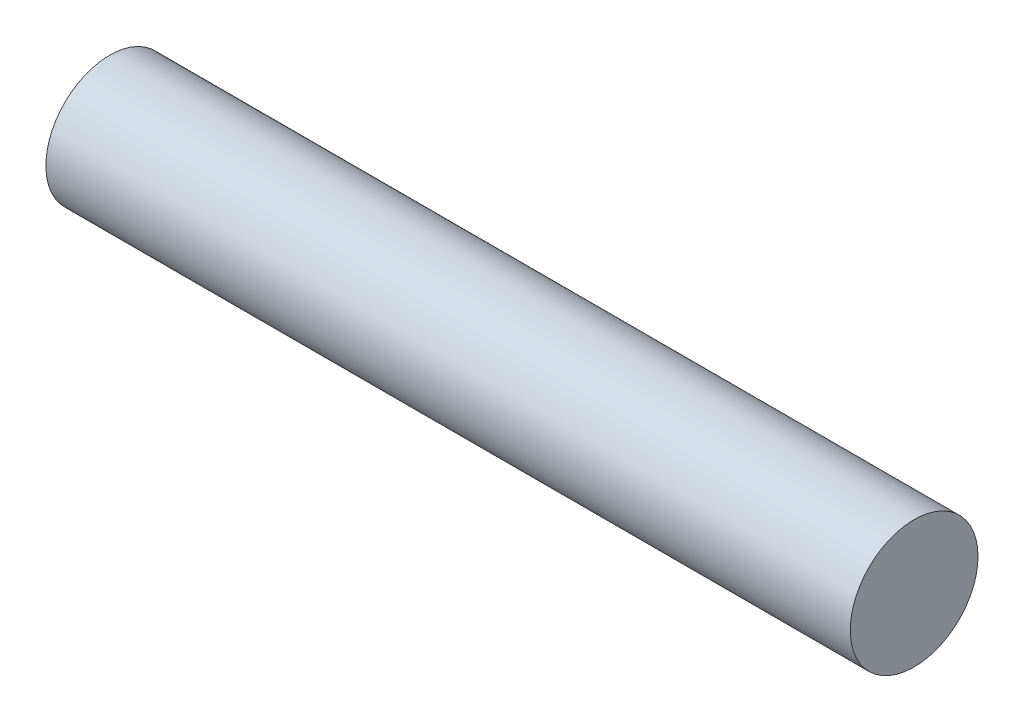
from build123d import *

# Parameters (mm, degrees)
SKETCH1_R           = 4.7625
BOSS_EXTRUDE1_DEPTH = 60


with BuildPart() as part:
    # Sketch1 → Boss-Extrude1 (new body)
    with BuildSketch(Plane(origin=(0, 0, 0), x_dir=(0, 0, -1), z_dir=(1, 0, 0))):
        Circle(SKETCH1_R)
    extrude(amount=BOSS_EXTRUDE1_DEPTH)


solid = part.part
